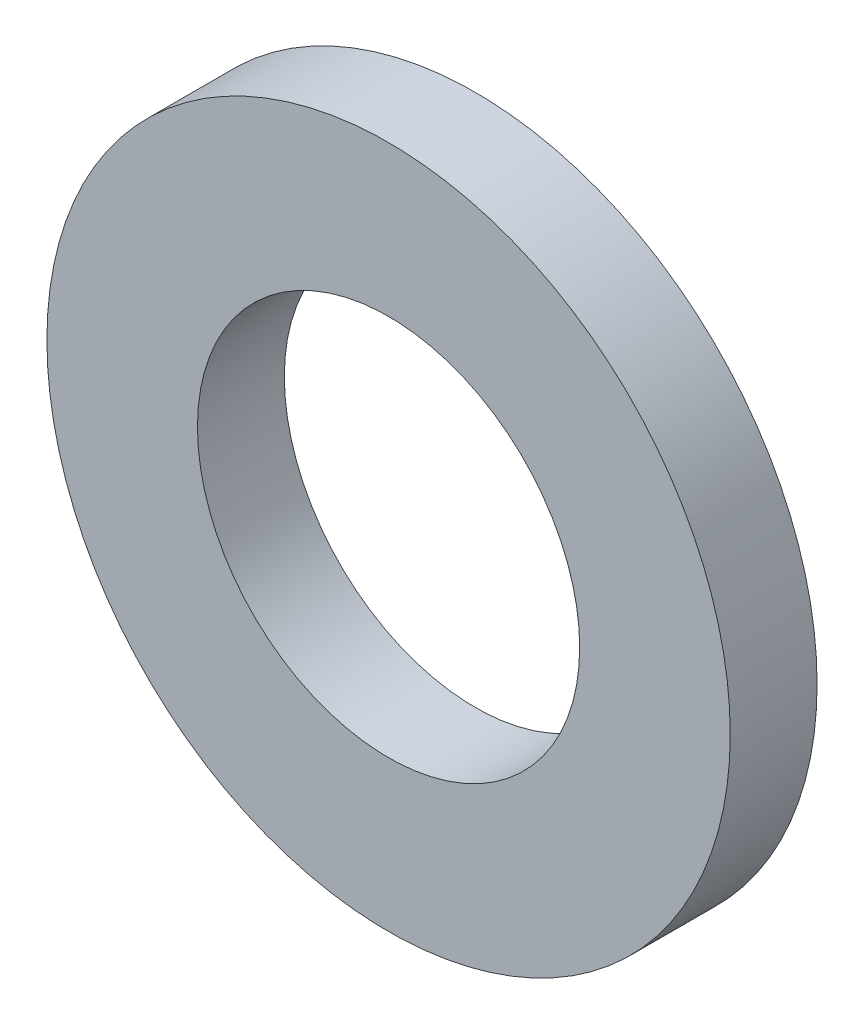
ISO-10303-21;
HEADER;
FILE_DESCRIPTION(('STEP AP214'),'2;1');
FILE_NAME('part.step','',(''),(''),'','','');
FILE_SCHEMA(('AUTOMOTIVE_DESIGN { 1 0 10303 214 1 1 1 1 }'));
ENDSEC;
DATA;
#1=APPLICATION_CONTEXT('core data for automotive mechanical design processes');
#2=APPLICATION_PROTOCOL_DEFINITION('international standard','automotive_design',2000,#1);
#3=PRODUCT_CONTEXT('',#1,'mechanical');
#4=PRODUCT('Part','Part','',(#3));
#5=PRODUCT_RELATED_PRODUCT_CATEGORY('part','',(#4));
#6=PRODUCT_DEFINITION_FORMATION('','',#4);
#7=PRODUCT_DEFINITION_CONTEXT('part definition',#1,'design');
#8=PRODUCT_DEFINITION('design','',#6,#7);
#9=PRODUCT_DEFINITION_SHAPE('','',#8);
#10=(LENGTH_UNIT() NAMED_UNIT(*) SI_UNIT(.MILLI.,.METRE.));
#11=(NAMED_UNIT(*) PLANE_ANGLE_UNIT() SI_UNIT($,.RADIAN.));
#12=(NAMED_UNIT(*) SI_UNIT($,.STERADIAN.) SOLID_ANGLE_UNIT());
#13=UNCERTAINTY_MEASURE_WITH_UNIT(LENGTH_MEASURE(1.E-05),#10,'distance_accuracy_value','');
#14=(GEOMETRIC_REPRESENTATION_CONTEXT(3) GLOBAL_UNCERTAINTY_ASSIGNED_CONTEXT((#13)) GLOBAL_UNIT_ASSIGNED_CONTEXT((#10,
#11,#12)) REPRESENTATION_CONTEXT('',''));
#15=CARTESIAN_POINT('',(0.,0.,0.));
#16=DIRECTION('',(0.,0.,1.));
#17=DIRECTION('',(1.,0.,0.));
#18=AXIS2_PLACEMENT_3D('',#15,#16,#17);
#19=CARTESIAN_POINT('',(0.,0.,1.5));
#20=DIRECTION('',(0.,0.,1.));
#21=DIRECTION('',(1.,0.,0.));
#22=AXIS2_PLACEMENT_3D('',#19,#20,#21);
#23=PLANE('',#22);
#24=CARTESIAN_POINT('',(0.,0.,1.5));
#25=DIRECTION('',(0.,0.,1.));
#26=DIRECTION('',(1.,0.,0.));
#27=AXIS2_PLACEMENT_3D('',#24,#25,#26);
#28=CIRCLE('',#27,5.9);
#29=CARTESIAN_POINT('',(5.9,0.,1.5));
#30=VERTEX_POINT('',#29);
#31=EDGE_CURVE('E10',#30,#30,#28,.T.);
#32=ORIENTED_EDGE('',*,*,#31,.T.);
#33=EDGE_LOOP('',(#32));
#34=FACE_BOUND('',#33,.T.);
#35=CARTESIAN_POINT('',(0.,0.,1.5));
#36=DIRECTION('',(0.,0.,1.));
#37=DIRECTION('',(1.,0.,0.));
#38=AXIS2_PLACEMENT_3D('',#35,#36,#37);
#39=CIRCLE('',#38,3.3);
#40=CARTESIAN_POINT('',(3.3,0.,1.5));
#41=VERTEX_POINT('',#40);
#42=EDGE_CURVE('E26',#41,#41,#39,.T.);
#43=ORIENTED_EDGE('',*,*,#42,.F.);
#44=EDGE_LOOP('',(#43));
#45=FACE_BOUND('',#44,.T.);
#46=ADVANCED_FACE('F15',(#34,#45),#23,.T.);
#47=CARTESIAN_POINT('',(0.,0.,0.));
#48=DIRECTION('',(0.,0.,1.));
#49=DIRECTION('',(1.,0.,0.));
#50=AXIS2_PLACEMENT_3D('',#47,#48,#49);
#51=PLANE('',#50);
#52=CARTESIAN_POINT('',(0.,0.,0.));
#53=DIRECTION('',(0.,0.,1.));
#54=DIRECTION('',(1.,0.,0.));
#55=AXIS2_PLACEMENT_3D('',#52,#53,#54);
#56=CIRCLE('',#55,5.9);
#57=CARTESIAN_POINT('',(5.9,0.,0.));
#58=VERTEX_POINT('',#57);
#59=EDGE_CURVE('E22',#58,#58,#56,.T.);
#60=ORIENTED_EDGE('',*,*,#59,.F.);
#61=EDGE_LOOP('',(#60));
#62=FACE_BOUND('',#61,.T.);
#63=CARTESIAN_POINT('',(0.,0.,0.));
#64=DIRECTION('',(0.,0.,1.));
#65=DIRECTION('',(1.,0.,0.));
#66=AXIS2_PLACEMENT_3D('',#63,#64,#65);
#67=CIRCLE('',#66,3.3);
#68=CARTESIAN_POINT('',(3.3,0.,0.));
#69=VERTEX_POINT('',#68);
#70=EDGE_CURVE('E30',#69,#69,#67,.T.);
#71=ORIENTED_EDGE('',*,*,#70,.T.);
#72=EDGE_LOOP('',(#71));
#73=FACE_BOUND('',#72,.T.);
#74=ADVANCED_FACE('F36',(#62,#73),#51,.F.);
#75=CARTESIAN_POINT('',(0.,0.,1.5));
#76=DIRECTION('',(0.,0.,-1.));
#77=DIRECTION('',(-1.,0.,0.));
#78=AXIS2_PLACEMENT_3D('',#75,#76,#77);
#79=CYLINDRICAL_SURFACE('',#78,5.9);
#80=ORIENTED_EDGE('',*,*,#31,.F.);
#81=EDGE_LOOP('',(#80));
#82=FACE_BOUND('',#81,.T.);
#83=ORIENTED_EDGE('',*,*,#59,.T.);
#84=EDGE_LOOP('',(#83));
#85=FACE_BOUND('',#84,.T.);
#86=ADVANCED_FACE('F17',(#82,#85),#79,.T.);
#87=CARTESIAN_POINT('',(0.,0.,1.5));
#88=DIRECTION('',(0.,0.,-1.));
#89=DIRECTION('',(-1.,0.,0.));
#90=AXIS2_PLACEMENT_3D('',#87,#88,#89);
#91=CYLINDRICAL_SURFACE('',#90,3.3);
#92=ORIENTED_EDGE('',*,*,#42,.T.);
#93=EDGE_LOOP('',(#92));
#94=FACE_BOUND('',#93,.T.);
#95=ORIENTED_EDGE('',*,*,#70,.F.);
#96=EDGE_LOOP('',(#95));
#97=FACE_BOUND('',#96,.T.);
#98=ADVANCED_FACE('F38',(#94,#97),#91,.F.);
#99=CLOSED_SHELL('',(#46,#74,#86,#98));
#100=MANIFOLD_SOLID_BREP('B1',#99);
#101=ADVANCED_BREP_SHAPE_REPRESENTATION('',(#18,#100),#14);
#102=SHAPE_DEFINITION_REPRESENTATION(#9,#101);
ENDSEC;
END-ISO-10303-21;
